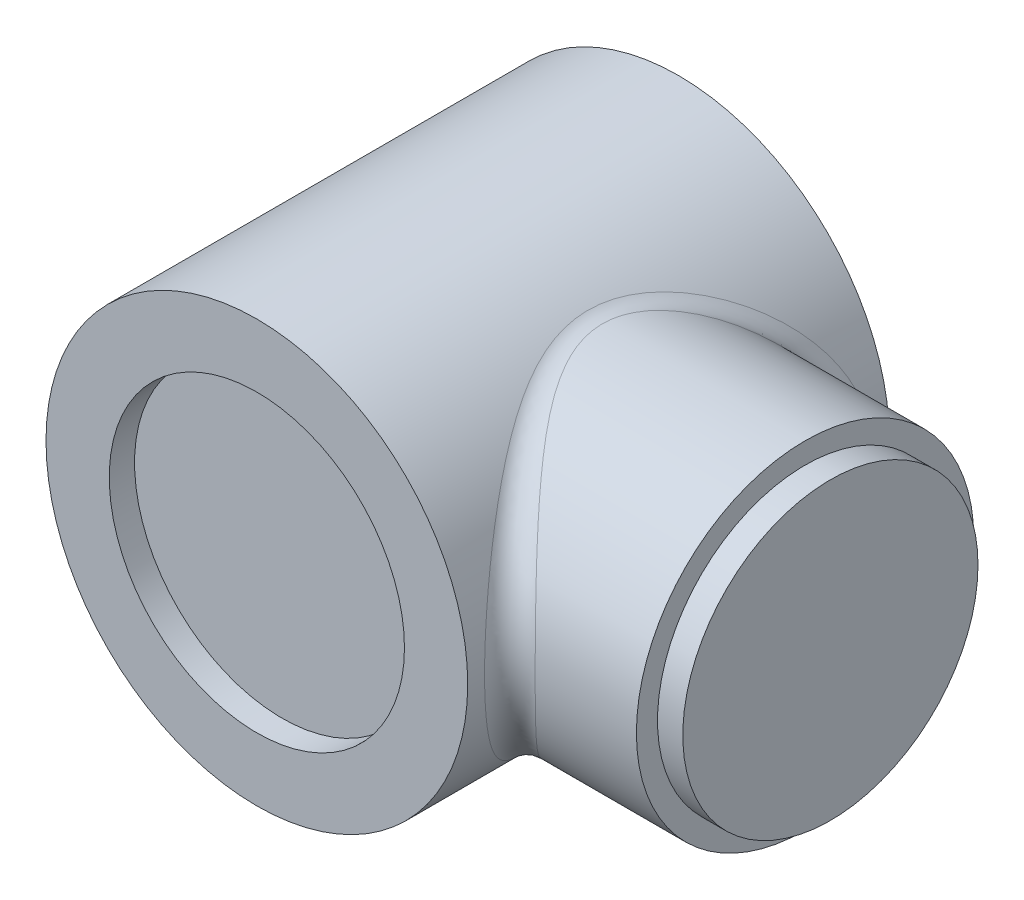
from build123d import *

# Parameters (mm, degrees)
SKETCH1_R           = 25
BOSS_EXTRUDE1_DEPTH = 25
SKETCH2_R           = 17.5
CUT_EXTRUDE1_DEPTH  = 3
SKETCH5_R           = 20
BOSS_EXTRUDE2_DEPTH = 40
SKETCH6_R           = 17.5
BOSS_EXTRUDE3_DEPTH = 3
FILLET1_R           = 3


with BuildPart() as part:
    # Sketch1 → Boss-Extrude1 (new, symmetric)
    with BuildSketch(Plane.XY):
        Circle(SKETCH1_R)
    extrude(amount=BOSS_EXTRUDE1_DEPTH, both=True)

    # Sketch2 → Cut-Extrude1 (cut)
    with BuildSketch(Plane.XY.offset(25)):
        Circle(SKETCH2_R)
    cut_extrude1 = extrude(amount=-CUT_EXTRUDE1_DEPTH, mode=Mode.SUBTRACT)

    # Mirror1: Cut-Extrude1 across plane
    add(cut_extrude1.mirror(Plane.XY), mode=Mode.SUBTRACT)

    # Sketch5 → Boss-Extrude2 (add)
    with BuildSketch(Plane(origin=(0, 0, 0), x_dir=(0, 0, -1), z_dir=(1, 0, 0))):
        Circle(SKETCH5_R)
    extrude(amount=BOSS_EXTRUDE2_DEPTH)

    # Sketch6 → Boss-Extrude3 (add)
    with BuildSketch(Plane(origin=(40, 0, 0), x_dir=(0, 0, -1), z_dir=(1, 0, 0))):
        Circle(SKETCH6_R)
    extrude(amount=BOSS_EXTRUDE3_DEPTH)

    # Fillet1
    fillet1_edges = [part.edges().sort_by_distance(p)[0] for p in [
        (15, 20, 0),
    ]]
    fillet(fillet1_edges, radius=FILLET1_R)


solid = part.part
